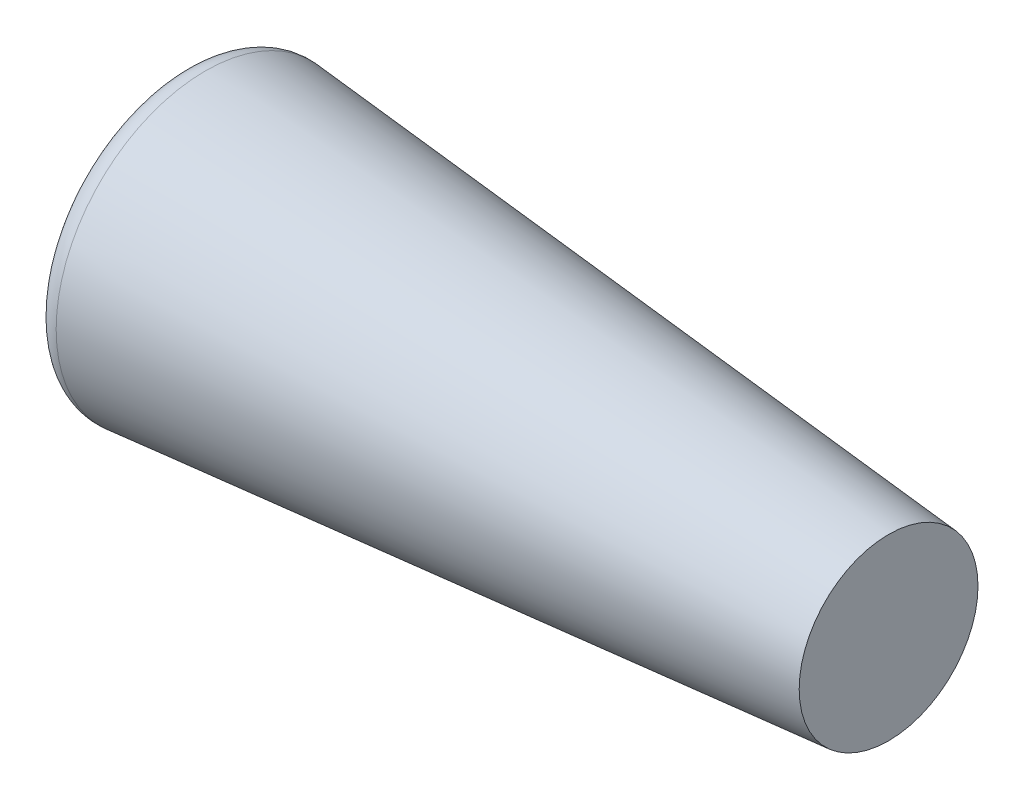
ISO-10303-21;
HEADER;
FILE_DESCRIPTION(('STEP AP214'),'2;1');
FILE_NAME('part.step','',(''),(''),'','','');
FILE_SCHEMA(('AUTOMOTIVE_DESIGN { 1 0 10303 214 1 1 1 1 }'));
ENDSEC;
DATA;
#1=APPLICATION_CONTEXT('core data for automotive mechanical design processes');
#2=APPLICATION_PROTOCOL_DEFINITION('international standard','automotive_design',2000,#1);
#3=PRODUCT_CONTEXT('',#1,'mechanical');
#4=PRODUCT('Part','Part','',(#3));
#5=PRODUCT_RELATED_PRODUCT_CATEGORY('part','',(#4));
#6=PRODUCT_DEFINITION_FORMATION('','',#4);
#7=PRODUCT_DEFINITION_CONTEXT('part definition',#1,'design');
#8=PRODUCT_DEFINITION('design','',#6,#7);
#9=PRODUCT_DEFINITION_SHAPE('','',#8);
#10=(LENGTH_UNIT() NAMED_UNIT(*) SI_UNIT(.MILLI.,.METRE.));
#11=(NAMED_UNIT(*) PLANE_ANGLE_UNIT() SI_UNIT($,.RADIAN.));
#12=(NAMED_UNIT(*) SI_UNIT($,.STERADIAN.) SOLID_ANGLE_UNIT());
#13=UNCERTAINTY_MEASURE_WITH_UNIT(LENGTH_MEASURE(1.E-05),#10,'distance_accuracy_value','');
#14=(GEOMETRIC_REPRESENTATION_CONTEXT(3) GLOBAL_UNCERTAINTY_ASSIGNED_CONTEXT((#13)) GLOBAL_UNIT_ASSIGNED_CONTEXT((#10,
#11,#12)) REPRESENTATION_CONTEXT('',''));
#15=CARTESIAN_POINT('',(0.,0.,0.));
#16=DIRECTION('',(0.,0.,1.));
#17=DIRECTION('',(1.,0.,0.));
#18=AXIS2_PLACEMENT_3D('',#15,#16,#17);
#19=CARTESIAN_POINT('',(0.,1.5,0.));
#20=DIRECTION('',(1.,0.,0.));
#21=DIRECTION('',(0.,0.,-1.));
#22=AXIS2_PLACEMENT_3D('',#19,#20,#21);
#23=PLANE('',#22);
#24=CARTESIAN_POINT('',(0.,0.,0.));
#25=DIRECTION('',(1.,0.,0.));
#26=DIRECTION('',(0.,0.,-1.));
#27=AXIS2_PLACEMENT_3D('',#24,#25,#26);
#28=CIRCLE('',#27,1.28173829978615);
#29=CARTESIAN_POINT('',(0.,0.,-1.28173829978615));
#30=VERTEX_POINT('',#29);
#31=EDGE_CURVE('E34',#30,#30,#28,.F.);
#32=ORIENTED_EDGE('',*,*,#31,.T.);
#33=EDGE_LOOP('',(#32));
#34=FACE_BOUND('',#33,.T.);
#35=ADVANCED_FACE('F28',(#34),#23,.F.);
#36=CARTESIAN_POINT('',(7.,0.,0.));
#37=DIRECTION('',(-1.,0.,0.));
#38=DIRECTION('',(0.,0.,1.));
#39=AXIS2_PLACEMENT_3D('',#36,#37,#38);
#40=PLANE('',#39);
#41=CARTESIAN_POINT('',(7.,0.,0.));
#42=DIRECTION('',(-1.,0.,0.));
#43=DIRECTION('',(0.,0.,1.));
#44=AXIS2_PLACEMENT_3D('',#41,#42,#43);
#45=CIRCLE('',#44,0.88757935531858);
#46=CARTESIAN_POINT('',(7.,0.,0.88757935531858));
#47=VERTEX_POINT('',#46);
#48=EDGE_CURVE('E38',#47,#47,#45,.T.);
#49=ORIENTED_EDGE('',*,*,#48,.F.);
#50=EDGE_LOOP('',(#49));
#51=FACE_BOUND('',#50,.T.);
#52=ADVANCED_FACE('F47',(#51),#40,.F.);
#53=CARTESIAN_POINT('',(7.,0.,0.));
#54=DIRECTION('',(-1.,0.,0.));
#55=DIRECTION('',(0.,0.,1.));
#56=AXIS2_PLACEMENT_3D('',#53,#54,#55);
#57=CONICAL_SURFACE('',#56,0.88757935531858,0.0872664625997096);
#58=CARTESIAN_POINT('',(0.217431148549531,0.,0.));
#59=DIRECTION('',(1.,0.,0.));
#60=DIRECTION('',(0.,0.,-1.));
#61=AXIS2_PLACEMENT_3D('',#58,#59,#60);
#62=CIRCLE('',#61,1.4809772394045);
#63=CARTESIAN_POINT('',(0.217431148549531,0.,-1.4809772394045));
#64=VERTEX_POINT('',#63);
#65=EDGE_CURVE('E10',#64,#64,#62,.T.);
#66=ORIENTED_EDGE('',*,*,#65,.T.);
#67=EDGE_LOOP('',(#66));
#68=FACE_BOUND('',#67,.T.);
#69=ORIENTED_EDGE('',*,*,#48,.T.);
#70=EDGE_LOOP('',(#69));
#71=FACE_BOUND('',#70,.T.);
#72=ADVANCED_FACE('F45',(#68,#71),#57,.T.);
#73=CARTESIAN_POINT('',(0.200000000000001,0.,0.));
#74=DIRECTION('',(1.,0.,0.));
#75=DIRECTION('',(0.,0.,-1.));
#76=AXIS2_PLACEMENT_3D('',#73,#74,#75);
#77=TOROIDAL_SURFACE('',#76,1.28173829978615,0.2);
#78=ORIENTED_EDGE('',*,*,#65,.F.);
#79=EDGE_LOOP('',(#78));
#80=FACE_BOUND('',#79,.T.);
#81=ORIENTED_EDGE('',*,*,#31,.F.);
#82=EDGE_LOOP('',(#81));
#83=FACE_BOUND('',#82,.T.);
#84=ADVANCED_FACE('F53',(#80,#83),#77,.T.);
#85=CLOSED_SHELL('',(#35,#52,#72,#84));
#86=MANIFOLD_SOLID_BREP('B2',#85);
#87=ADVANCED_BREP_SHAPE_REPRESENTATION('',(#18,#86),#14);
#88=SHAPE_DEFINITION_REPRESENTATION(#9,#87);
ENDSEC;
END-ISO-10303-21;
